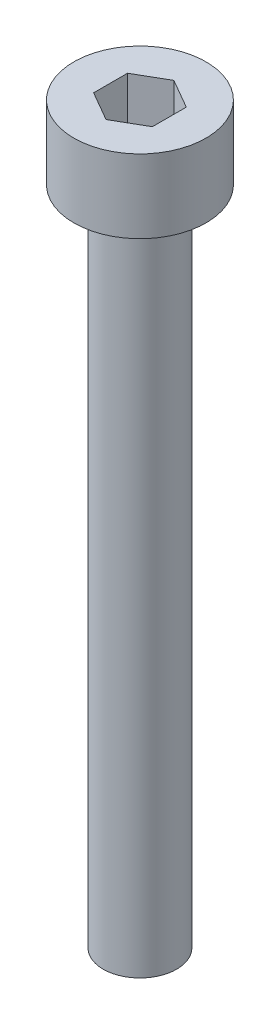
from build123d import *

# Parameters (mm, degrees)
ESQUISSE1_R             = 4.5
BOSS_EXTRU_1_DEPTH      = 5
ENL_V_MAT_EXTRU_1_DEPTH = 3
ESQUISSE3_R             = 2.5
BOSS_EXTRU_2_DEPTH      = 45


with BuildPart() as part:
    # Esquisse1 → Boss.-Extru.1 (new body)
    with BuildSketch(Plane(origin=(0, 0, 0), x_dir=(1, 0, 0), z_dir=(0, 1, 0))):
        with Locations(Location((0, 0, 0), (0, 0, 270))):
            Circle(ESQUISSE1_R)
    extrude(amount=BOSS_EXTRU_1_DEPTH)

    # Esquisse2 → Enl_v. mat.-Extru.1 (cut)
    with BuildSketch(Plane(origin=(0, 5, 0), x_dir=(1, 0, 0), z_dir=(0, 1, 0))):
        Polygon((2, -1.154700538), (2, 1.154700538), (0, 2.309401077), (-2, 1.154700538), (-2, -1.154700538), (0, -2.309401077), align=None)
    extrude(amount=-ENL_V_MAT_EXTRU_1_DEPTH, mode=Mode.SUBTRACT)

    # Esquisse3 → Boss.-Extru.2 (add)
    with BuildSketch(Plane.XZ):
        with Locations(Location((0, 0, 0), (0, 0, 90))):
            Circle(ESQUISSE3_R)
    extrude(amount=BOSS_EXTRU_2_DEPTH)


solid = part.part
